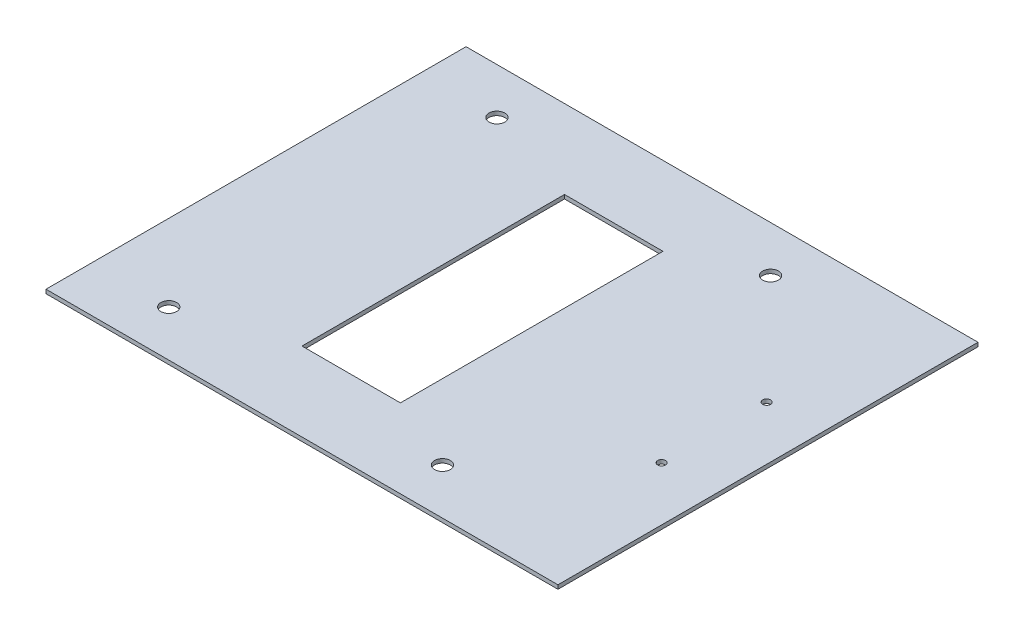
from build123d import *

# Parameters (mm, degrees)
ESQUISSE1_W             = 390
ESQUISSE1_H             = 320
BASE_EXTRUSION_DEPTH    = 3
ESQUISSE2_W             = 75
ESQUISSE2_H             = 200
ENL_V_MAT_EXTRU_1_DEPTH = 4
ESQUISSE3_R             = 6
ENL_V_MAT_EXTRU_2_DEPTH = 4
ESQUISSE4_R             = 3
ENL_V_MAT_EXTRU_3_DEPTH = 10


with BuildPart() as part:
    # Esquisse1 → Base-Extrusion (new body)
    with BuildSketch(Plane(origin=(0, 0, 0), x_dir=(1, 0, 0), z_dir=(0, 1, 0))):
        with Locations((195, 160)):
            Rectangle(ESQUISSE1_W, ESQUISSE1_H)
    extrude(amount=BASE_EXTRUSION_DEPTH)

    # Esquisse2 → Enl_v. mat.-Extru.1 (cut)
    with BuildSketch(Plane(origin=(0, 3, 0), x_dir=(-1, 0, 0), z_dir=(0, 1, 0))):
        with Locations((-172.5, -160)):
            Rectangle(ESQUISSE2_W, ESQUISSE2_H)
    extrude(amount=-ENL_V_MAT_EXTRU_1_DEPTH, mode=Mode.SUBTRACT)

    # Esquisse3 → Enl_v. mat.-Extru.2 (cut)
    with BuildSketch(Plane(origin=(0, 3, 0), x_dir=(-1, 0, 0), z_dir=(0, 1, 0))):
        with Locations(Location((-267, -285, 0), (0, 0, 90))):
            Circle(ESQUISSE3_R)
        with Locations(Location((-58.5, -285, 0), (0, 0, 90))):
            Circle(ESQUISSE3_R)
        with Locations(Location((-267, -35, 0), (0, 0, 90))):
            Circle(ESQUISSE3_R)
        with Locations(Location((-58.5, -35, 0), (0, 0, 90))):
            Circle(ESQUISSE3_R)
    extrude(amount=-ENL_V_MAT_EXTRU_2_DEPTH, mode=Mode.SUBTRACT)

    # Esquisse4 → Enl_v. mat.-Extru.3 (cut)
    with BuildSketch(Plane(origin=(0, 3, 0), x_dir=(-1, 0, 0), z_dir=(0, 1, 0))):
        with Locations(Location((-349, -200, 0), (0, 0, 90))):
            Circle(ESQUISSE4_R)
        with Locations(Location((-349, -120, 0), (0, 0, 90))):
            Circle(ESQUISSE4_R)
    extrude(amount=-ENL_V_MAT_EXTRU_3_DEPTH, mode=Mode.SUBTRACT)


solid = part.part
